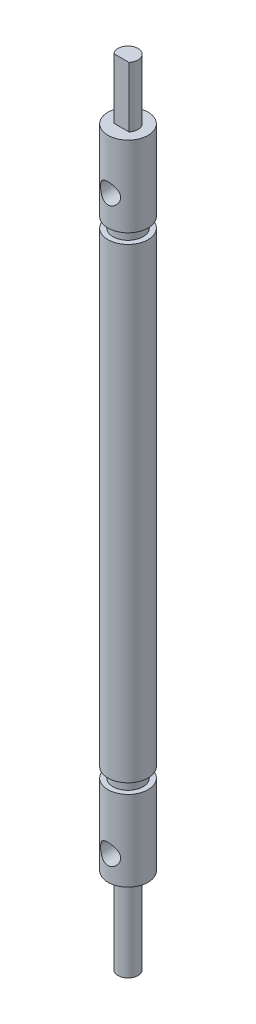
ISO-10303-21;
HEADER;
FILE_DESCRIPTION(('STEP AP214'),'2;1');
FILE_NAME('part.step','',(''),(''),'','','');
FILE_SCHEMA(('AUTOMOTIVE_DESIGN { 1 0 10303 214 1 1 1 1 }'));
ENDSEC;
DATA;
#1=APPLICATION_CONTEXT('core data for automotive mechanical design processes');
#2=APPLICATION_PROTOCOL_DEFINITION('international standard','automotive_design',2000,#1);
#3=PRODUCT_CONTEXT('',#1,'mechanical');
#4=PRODUCT('Part','Part','',(#3));
#5=PRODUCT_RELATED_PRODUCT_CATEGORY('part','',(#4));
#6=PRODUCT_DEFINITION_FORMATION('','',#4);
#7=PRODUCT_DEFINITION_CONTEXT('part definition',#1,'design');
#8=PRODUCT_DEFINITION('design','',#6,#7);
#9=PRODUCT_DEFINITION_SHAPE('','',#8);
#10=(LENGTH_UNIT() NAMED_UNIT(*) SI_UNIT(.MILLI.,.METRE.));
#11=(NAMED_UNIT(*) PLANE_ANGLE_UNIT() SI_UNIT($,.RADIAN.));
#12=(NAMED_UNIT(*) SI_UNIT($,.STERADIAN.) SOLID_ANGLE_UNIT());
#13=UNCERTAINTY_MEASURE_WITH_UNIT(LENGTH_MEASURE(1.E-05),#10,'distance_accuracy_value','');
#14=(GEOMETRIC_REPRESENTATION_CONTEXT(3) GLOBAL_UNCERTAINTY_ASSIGNED_CONTEXT((#13)) GLOBAL_UNIT_ASSIGNED_CONTEXT((#10,
#11,#12)) REPRESENTATION_CONTEXT('',''));
#15=CARTESIAN_POINT('',(0.,0.,0.));
#16=DIRECTION('',(0.,0.,1.));
#17=DIRECTION('',(1.,0.,0.));
#18=AXIS2_PLACEMENT_3D('',#15,#16,#17);
#19=CARTESIAN_POINT('',(1.,0.,0.));
#20=DIRECTION('',(0.,-1.,0.));
#21=DIRECTION('',(0.,0.,-1.));
#22=AXIS2_PLACEMENT_3D('',#19,#20,#21);
#23=PLANE('',#22);
#24=CARTESIAN_POINT('',(0.,0.,0.));
#25=DIRECTION('',(0.,-1.,0.));
#26=DIRECTION('',(0.,0.,-1.));
#27=AXIS2_PLACEMENT_3D('',#24,#25,#26);
#28=CIRCLE('',#27,1.);
#29=CARTESIAN_POINT('',(0.,0.,-1.));
#30=VERTEX_POINT('',#29);
#31=EDGE_CURVE('E123',#30,#30,#28,.T.);
#32=ORIENTED_EDGE('',*,*,#31,.T.);
#33=EDGE_LOOP('',(#32));
#34=FACE_BOUND('',#33,.T.);
#35=ADVANCED_FACE('F29',(#34),#23,.T.);
#36=CARTESIAN_POINT('',(0.,79.,0.));
#37=DIRECTION('',(0.,1.,0.));
#38=DIRECTION('',(0.,0.,1.));
#39=AXIS2_PLACEMENT_3D('',#36,#37,#38);
#40=PLANE('',#39);
#41=DIRECTION('',(-1.,0.,0.));
#42=VECTOR('',#41,1.);
#43=CARTESIAN_POINT('',(-0.75,79.,0.661437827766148));
#44=LINE('',#43,#42);
#45=CARTESIAN_POINT('',(0.75,79.,0.661437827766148));
#46=VERTEX_POINT('',#45);
#47=CARTESIAN_POINT('',(-0.75,79.,0.661437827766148));
#48=VERTEX_POINT('',#47);
#49=EDGE_CURVE('E59',#46,#48,#44,.T.);
#50=ORIENTED_EDGE('',*,*,#49,.F.);
#51=CARTESIAN_POINT('',(0.,79.,0.));
#52=DIRECTION('',(0.,-1.,0.));
#53=DIRECTION('',(0.,0.,-1.));
#54=AXIS2_PLACEMENT_3D('',#51,#52,#53);
#55=CIRCLE('',#54,1.);
#56=EDGE_CURVE('E69',#48,#46,#55,.T.);
#57=ORIENTED_EDGE('',*,*,#56,.F.);
#58=EDGE_LOOP('',(#50,#57));
#59=FACE_BOUND('',#58,.T.);
#60=ADVANCED_FACE('F68',(#59),#40,.T.);
#61=CARTESIAN_POINT('',(0.,0.,0.));
#62=DIRECTION('',(0.,-1.,0.));
#63=DIRECTION('',(0.,0.,-1.));
#64=AXIS2_PLACEMENT_3D('',#61,#62,#63);
#65=CYLINDRICAL_SURFACE('',#64,1.);
#66=DIRECTION('',(0.,1.,0.));
#67=VECTOR('',#66,1.);
#68=CARTESIAN_POINT('',(0.75,73.,0.661437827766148));
#69=LINE('',#68,#67);
#70=CARTESIAN_POINT('',(0.75,73.,0.661437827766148));
#71=VERTEX_POINT('',#70);
#72=EDGE_CURVE('E56',#71,#46,#69,.T.);
#73=ORIENTED_EDGE('',*,*,#72,.F.);
#74=CARTESIAN_POINT('',(0.,73.,0.));
#75=DIRECTION('',(0.,-1.,0.));
#76=DIRECTION('',(0.,0.,-1.));
#77=AXIS2_PLACEMENT_3D('',#74,#75,#76);
#78=CIRCLE('',#77,1.);
#79=CARTESIAN_POINT('',(-0.750000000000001,73.,0.661437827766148));
#80=VERTEX_POINT('',#79);
#81=EDGE_CURVE('E73',#80,#71,#78,.T.);
#82=ORIENTED_EDGE('',*,*,#81,.F.);
#83=DIRECTION('',(0.,1.,0.));
#84=VECTOR('',#83,1.);
#85=CARTESIAN_POINT('',(-0.75,73.,0.661437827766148));
#86=LINE('',#85,#84);
#87=EDGE_CURVE('E64',#80,#48,#86,.T.);
#88=ORIENTED_EDGE('',*,*,#87,.T.);
#89=ORIENTED_EDGE('',*,*,#56,.T.);
#90=EDGE_LOOP('',(#73,#82,#88,#89));
#91=FACE_BOUND('',#90,.T.);
#92=ADVANCED_FACE('F71',(#91),#65,.T.);
#93=CARTESIAN_POINT('',(1.,73.,0.));
#94=DIRECTION('',(0.,1.,0.));
#95=DIRECTION('',(0.,0.,1.));
#96=AXIS2_PLACEMENT_3D('',#93,#94,#95);
#97=PLANE('',#96);
#98=ORIENTED_EDGE('',*,*,#81,.T.);
#99=DIRECTION('',(-1.,0.,0.));
#100=VECTOR('',#99,1.);
#101=CARTESIAN_POINT('',(-0.75,73.,0.661437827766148));
#102=LINE('',#101,#100);
#103=EDGE_CURVE('E46',#71,#80,#102,.T.);
#104=ORIENTED_EDGE('',*,*,#103,.T.);
#105=EDGE_LOOP('',(#98,#104));
#106=FACE_BOUND('',#105,.T.);
#107=CARTESIAN_POINT('',(0.,73.,0.));
#108=DIRECTION('',(0.,-1.,0.));
#109=DIRECTION('',(0.,0.,-1.));
#110=AXIS2_PLACEMENT_3D('',#107,#108,#109);
#111=CIRCLE('',#110,2.);
#112=CARTESIAN_POINT('',(0.,73.,-2.));
#113=VERTEX_POINT('',#112);
#114=EDGE_CURVE('E78',#113,#113,#111,.T.);
#115=ORIENTED_EDGE('',*,*,#114,.F.);
#116=EDGE_LOOP('',(#115));
#117=FACE_BOUND('',#116,.T.);
#118=ADVANCED_FACE('F162',(#106,#117),#97,.T.);
#119=CARTESIAN_POINT('',(0.,0.,0.));
#120=DIRECTION('',(0.,-1.,0.));
#121=DIRECTION('',(0.,0.,-1.));
#122=AXIS2_PLACEMENT_3D('',#119,#120,#121);
#123=CYLINDRICAL_SURFACE('',#122,2.);
#124=CARTESIAN_POINT('',(0.,69.,-2.));
#125=CARTESIAN_POINT('',(0.052571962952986,68.9999966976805,-1.99999713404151));
#126=CARTESIAN_POINT('',(0.105206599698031,68.9958299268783,-1.99790491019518));
#127=CARTESIAN_POINT('',(0.208920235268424,68.9793471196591,-1.98974156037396));
#128=CARTESIAN_POINT('',(0.259996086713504,68.9670156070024,-1.98366287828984));
#129=CARTESIAN_POINT('',(0.358933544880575,68.9348061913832,-1.96816279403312));
#130=CARTESIAN_POINT('',(0.40680680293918,68.914957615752,-1.9587543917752));
#131=CARTESIAN_POINT('',(0.498472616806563,68.8684293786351,-1.93745776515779));
#132=CARTESIAN_POINT('',(0.542265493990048,68.8417502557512,-1.9255697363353));
#133=CARTESIAN_POINT('',(0.627507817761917,68.7804827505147,-1.89956258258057));
#134=CARTESIAN_POINT('',(0.668655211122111,68.7455135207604,-1.88535199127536));
#135=CARTESIAN_POINT('',(0.744779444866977,68.669478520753,-1.85659970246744));
#136=CARTESIAN_POINT('',(0.779751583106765,68.6284081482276,-1.84205776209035));
#137=CARTESIAN_POINT('',(0.845252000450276,68.5375166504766,-1.81298951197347));
#138=CARTESIAN_POINT('',(0.875225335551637,68.4872639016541,-1.79855186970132));
#139=CARTESIAN_POINT('',(0.926168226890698,68.3816326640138,-1.77285978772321));
#140=CARTESIAN_POINT('',(0.947144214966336,68.3262578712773,-1.7616030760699));
#141=CARTESIAN_POINT('',(0.97813244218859,68.2153348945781,-1.74457867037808));
#142=CARTESIAN_POINT('',(0.988725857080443,68.1599955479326,-1.73852271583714));
#143=CARTESIAN_POINT('',(1.00042699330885,68.0480211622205,-1.73181889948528));
#144=CARTESIAN_POINT('',(1.00154408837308,67.9913874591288,-1.73116569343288));
#145=CARTESIAN_POINT('',(0.994687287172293,67.8857139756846,-1.73510930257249));
#146=CARTESIAN_POINT('',(0.98778455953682,67.836575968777,-1.73908763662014));
#147=CARTESIAN_POINT('',(0.966939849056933,67.740278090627,-1.7507622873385));
#148=CARTESIAN_POINT('',(0.952995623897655,67.6931188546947,-1.75845978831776));
#149=CARTESIAN_POINT('',(0.918209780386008,67.6007708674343,-1.77687476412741));
#150=CARTESIAN_POINT('',(0.897215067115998,67.5556536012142,-1.78765840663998));
#151=CARTESIAN_POINT('',(0.849041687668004,67.46936570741,-1.81103404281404));
#152=CARTESIAN_POINT('',(0.821860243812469,67.4281968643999,-1.82362684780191));
#153=CARTESIAN_POINT('',(0.758066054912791,67.3454787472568,-1.85113157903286));
#154=CARTESIAN_POINT('',(0.720694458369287,67.3045431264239,-1.86613510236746));
#155=CARTESIAN_POINT('',(0.639555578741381,67.2292645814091,-1.89547623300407));
#156=CARTESIAN_POINT('',(0.595785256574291,67.1949248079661,-1.90981351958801));
#157=CARTESIAN_POINT('',(0.50051650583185,67.1323143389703,-1.93701987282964));
#158=CARTESIAN_POINT('',(0.448753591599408,67.1043995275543,-1.94978984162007));
#159=CARTESIAN_POINT('',(0.340466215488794,67.057902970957,-1.97157881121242));
#160=CARTESIAN_POINT('',(0.283945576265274,67.0393138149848,-1.98060078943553));
#161=CARTESIAN_POINT('',(0.1727664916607,67.0135245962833,-1.99324333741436));
#162=CARTESIAN_POINT('',(0.118341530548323,67.0055087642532,-1.99724938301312));
#163=CARTESIAN_POINT('',(0.00877959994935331,66.9985352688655,-2.00073013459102));
#164=CARTESIAN_POINT('',(-0.0463570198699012,66.9995733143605,-2.00020698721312));
#165=CARTESIAN_POINT('',(-0.151232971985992,67.0102066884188,-1.99491192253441));
#166=CARTESIAN_POINT('',(-0.201059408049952,67.01913253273,-1.9904724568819));
#167=CARTESIAN_POINT('',(-0.298406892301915,67.0442380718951,-1.97822171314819));
#168=CARTESIAN_POINT('',(-0.345927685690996,67.0604185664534,-1.97041006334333));
#169=CARTESIAN_POINT('',(-0.438888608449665,67.0999984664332,-1.9518425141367));
#170=CARTESIAN_POINT('',(-0.484230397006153,67.1235910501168,-1.94100881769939));
#171=CARTESIAN_POINT('',(-0.570461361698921,67.177107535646,-1.91743974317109));
#172=CARTESIAN_POINT('',(-0.611348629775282,67.2070341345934,-1.90470355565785));
#173=CARTESIAN_POINT('',(-0.691767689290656,67.2757604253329,-1.87708221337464));
#174=CARTESIAN_POINT('',(-0.730772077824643,67.3151428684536,-1.86210884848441));
#175=CARTESIAN_POINT('',(-0.801856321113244,67.3999251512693,-1.83262391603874));
#176=CARTESIAN_POINT('',(-0.833931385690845,67.4453291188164,-1.81811267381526));
#177=CARTESIAN_POINT('',(-0.891707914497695,67.5436436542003,-1.79051192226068));
#178=CARTESIAN_POINT('',(-0.917025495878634,67.5968112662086,-1.77752529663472));
#179=CARTESIAN_POINT('',(-0.958082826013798,67.7075100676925,-1.75574072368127));
#180=CARTESIAN_POINT('',(-0.973834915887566,67.7650355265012,-1.74693738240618));
#181=CARTESIAN_POINT('',(-0.993861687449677,67.8769102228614,-1.73561501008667));
#182=CARTESIAN_POINT('',(-0.999092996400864,67.931034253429,-1.73257383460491));
#183=CARTESIAN_POINT('',(-1.00068915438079,68.0394470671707,-1.73165354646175));
#184=CARTESIAN_POINT('',(-0.9970578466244,68.0937357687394,-1.73377219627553));
#185=CARTESIAN_POINT('',(-0.981926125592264,68.195483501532,-1.74237862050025));
#186=CARTESIAN_POINT('',(-0.971208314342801,68.2431004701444,-1.74843094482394));
#187=CARTESIAN_POINT('',(-0.943175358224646,68.3358081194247,-1.76371016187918));
#188=CARTESIAN_POINT('',(-0.92585809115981,68.380897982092,-1.77293807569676));
#189=CARTESIAN_POINT('',(-0.883815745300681,68.4706248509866,-1.79428530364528));
#190=CARTESIAN_POINT('',(-0.858671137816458,68.5150279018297,-1.80655722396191));
#191=CARTESIAN_POINT('',(-0.802150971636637,68.5992745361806,-1.8323533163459));
#192=CARTESIAN_POINT('',(-0.770772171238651,68.6391157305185,-1.84587813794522));
#193=CARTESIAN_POINT('',(-0.698203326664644,68.7181419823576,-1.87462323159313));
#194=CARTESIAN_POINT('',(-0.656284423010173,68.7566591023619,-1.88984983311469));
#195=CARTESIAN_POINT('',(-0.566154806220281,68.8262629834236,-1.91877752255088));
#196=CARTESIAN_POINT('',(-0.517940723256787,68.8573457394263,-1.9324777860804));
#197=CARTESIAN_POINT('',(-0.41593159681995,68.9112363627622,-1.95698009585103));
#198=CARTESIAN_POINT('',(-0.36209950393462,68.9339841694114,-1.96776096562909));
#199=CARTESIAN_POINT('',(-0.250742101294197,68.969808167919,-1.98501341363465));
#200=CARTESIAN_POINT('',(-0.193227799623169,68.9829118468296,-1.99149723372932));
#201=CARTESIAN_POINT('',(-0.112601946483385,68.9938974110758,-1.99695461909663));
#202=CARTESIAN_POINT('',(-0.0901618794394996,68.9961826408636,-1.99809365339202));
#203=CARTESIAN_POINT('',(-0.0451517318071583,68.9992346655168,-1.99961696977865));
#204=CARTESIAN_POINT('',(-0.0225816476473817,69.0000014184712,-2.00000123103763));
#205=CARTESIAN_POINT('',(0.,69.,-2.));
#206=B_SPLINE_CURVE_WITH_KNOTS('',3,(#124,#125,#126,#127,#128,#129,#130,#131,#132,#133,#134,
#135,#136,#137,#138,#139,#140,#141,#142,#143,#144,#145,#146,#147,#148,#149,#150,#151,#152,#153,
#154,#155,#156,#157,#158,#159,#160,#161,#162,#163,#164,#165,#166,#167,#168,#169,#170,#171,#172,
#173,#174,#175,#176,#177,#178,#179,#180,#181,#182,#183,#184,#185,#186,#187,#188,#189,#190,#191,
#192,#193,#194,#195,#196,#197,#198,#199,#200,#201,#202,#203,#204,#205),.UNSPECIFIED.,.T.,.F.,(4,
2,2,2,2,2,2,2,2,2,2,2,2,2,2,2,2,2,2,2,2,2,2,2,2,2,2,2,2,2,2,2,2,2,2,2,2,2,2,2,4),(0.,
0.157624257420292,0.315548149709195,0.472862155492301,0.630163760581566,0.796981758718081,
0.963926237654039,1.14381726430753,1.32357947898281,1.4925801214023,1.66141357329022,
1.8100571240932,1.95874803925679,2.11090240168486,2.26312521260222,2.43464941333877,
2.60625534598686,2.78583022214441,2.9652621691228,3.12983290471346,3.29432564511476,
3.44606906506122,3.59782921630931,3.75392856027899,3.91009450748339,4.0815961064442,
4.25321588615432,4.43314682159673,4.61284511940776,4.77529307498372,4.93767059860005,
5.08457930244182,5.23153528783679,5.38836456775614,5.54527561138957,5.72125242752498,
5.89732383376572,6.07464013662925,6.2514490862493,6.31915280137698,6.38685838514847),.UNSPECIFIED.);
#207=CARTESIAN_POINT('',(0.,69.,-2.));
#208=VERTEX_POINT('',#207);
#209=EDGE_CURVE('E11',#208,#208,#206,.T.);
#210=ORIENTED_EDGE('',*,*,#209,.F.);
#211=EDGE_LOOP('',(#210));
#212=FACE_BOUND('',#211,.T.);
#213=CARTESIAN_POINT('',(1.,68.,1.73205080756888));
#214=CARTESIAN_POINT('',(0.999996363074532,68.0521078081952,1.73205534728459));
#215=CARTESIAN_POINT('',(0.995899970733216,68.1042814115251,1.73443801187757));
#216=CARTESIAN_POINT('',(0.979723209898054,68.2070272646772,1.74362366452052));
#217=CARTESIAN_POINT('',(0.967626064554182,68.2575959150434,1.75043594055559));
#218=CARTESIAN_POINT('',(0.936099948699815,68.3554516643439,1.76749346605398));
#219=CARTESIAN_POINT('',(0.916709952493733,68.4027546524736,1.77772043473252));
#220=CARTESIAN_POINT('',(0.871267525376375,68.4934242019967,1.80042664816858));
#221=CARTESIAN_POINT('',(0.845214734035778,68.5367905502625,1.81290601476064));
#222=CARTESIAN_POINT('',(0.784666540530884,68.6223057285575,1.83996869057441));
#223=CARTESIAN_POINT('',(0.749652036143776,68.6640591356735,1.85464063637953));
#224=CARTESIAN_POINT('',(0.673253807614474,68.7414083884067,1.88371982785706));
#225=CARTESIAN_POINT('',(0.631866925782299,68.7770011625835,1.8981269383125));
#226=CARTESIAN_POINT('',(0.540489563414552,68.8433671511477,1.92621476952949));
#227=CARTESIAN_POINT('',(0.490107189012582,68.8736537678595,1.93978106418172));
#228=CARTESIAN_POINT('',(0.384157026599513,68.9251408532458,1.96350756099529));
#229=CARTESIAN_POINT('',(0.328592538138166,68.9463470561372,1.97366991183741));
#230=CARTESIAN_POINT('',(0.21804494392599,68.9775046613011,1.98880461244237));
#231=CARTESIAN_POINT('',(0.16330179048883,68.9881495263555,1.99409480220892));
#232=CARTESIAN_POINT('',(0.0525706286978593,69.000166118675,2.00007583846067));
#233=CARTESIAN_POINT('',(-0.00341660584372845,69.0015434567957,2.0007694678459));
#234=CARTESIAN_POINT('',(-0.109832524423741,68.9952533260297,1.9976298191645));
#235=CARTESIAN_POINT('',(-0.160321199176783,68.9883619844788,1.99418495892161));
#236=CARTESIAN_POINT('',(-0.259313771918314,68.9671191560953,1.98374245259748));
#237=CARTESIAN_POINT('',(-0.307817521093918,68.9527671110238,1.97674454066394));
#238=CARTESIAN_POINT('',(-0.402309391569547,68.9169174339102,1.95971583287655));
#239=CARTESIAN_POINT('',(-0.448253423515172,68.895323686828,1.94964441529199));
#240=CARTESIAN_POINT('',(-0.535976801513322,68.8457365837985,1.92737645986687));
#241=CARTESIAN_POINT('',(-0.577754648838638,68.8177409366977,1.91517916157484));
#242=CARTESIAN_POINT('',(-0.660173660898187,68.753104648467,1.8884439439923));
#243=CARTESIAN_POINT('',(-0.700334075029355,68.715896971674,1.87379375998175));
#244=CARTESIAN_POINT('',(-0.774104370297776,68.6354102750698,1.84454340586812));
#245=CARTESIAN_POINT('',(-0.807709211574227,68.5921266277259,1.82994328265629));
#246=CARTESIAN_POINT('',(-0.869505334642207,68.4973518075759,1.80144156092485));
#247=CARTESIAN_POINT('',(-0.897217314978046,68.4455139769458,1.78764319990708));
#248=CARTESIAN_POINT('',(-0.943319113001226,68.337062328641,1.76375450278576));
#249=CARTESIAN_POINT('',(-0.961718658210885,68.2804535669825,1.75366030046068));
#250=CARTESIAN_POINT('',(-0.987180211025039,68.1687854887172,1.73944635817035));
#251=CARTESIAN_POINT('',(-0.995025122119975,68.1139588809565,1.73491655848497));
#252=CARTESIAN_POINT('',(-1.00151694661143,68.0035986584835,1.7311791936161));
#253=CARTESIAN_POINT('',(-1.00017035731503,67.9480655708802,1.73196786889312));
#254=CARTESIAN_POINT('',(-0.989036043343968,67.8443460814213,1.73834336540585));
#255=CARTESIAN_POINT('',(-0.98018781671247,67.7960205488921,1.74339587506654));
#256=CARTESIAN_POINT('',(-0.955696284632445,67.7016322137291,1.75694021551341));
#257=CARTESIAN_POINT('',(-0.940050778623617,67.6555701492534,1.76543316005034));
#258=CARTESIAN_POINT('',(-0.90164758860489,67.5645886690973,1.78536222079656));
#259=CARTESIAN_POINT('',(-0.87859406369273,67.5198209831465,1.79691643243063));
#260=CARTESIAN_POINT('',(-0.826287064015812,67.434530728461,1.82156119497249));
#261=CARTESIAN_POINT('',(-0.797030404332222,67.3940103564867,1.83465253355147));
#262=CARTESIAN_POINT('',(-0.728837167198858,67.3130212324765,1.86287998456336));
#263=CARTESIAN_POINT('',(-0.689145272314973,67.2732028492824,1.87806583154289));
#264=CARTESIAN_POINT('',(-0.603404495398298,67.2005877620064,1.90734234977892));
#265=CARTESIAN_POINT('',(-0.557353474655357,67.1677934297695,1.92143265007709));
#266=CARTESIAN_POINT('',(-0.45853536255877,67.1094262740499,1.94741361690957));
#267=CARTESIAN_POINT('',(-0.405623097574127,67.0840668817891,1.95923641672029));
#268=CARTESIAN_POINT('',(-0.295522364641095,67.0428620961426,1.97883354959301));
#269=CARTESIAN_POINT('',(-0.238337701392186,67.0270083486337,1.98661143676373));
#270=CARTESIAN_POINT('',(-0.126979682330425,67.0066314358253,1.99667508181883));
#271=CARTESIAN_POINT('',(-0.0730114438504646,67.0012021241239,1.99939927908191));
#272=CARTESIAN_POINT('',(0.0351259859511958,66.9991567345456,2.00042130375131));
#273=CARTESIAN_POINT('',(0.0892951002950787,67.0025375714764,1.9987206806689));
#274=CARTESIAN_POINT('',(0.19253799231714,67.0174164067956,1.99133968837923));
#275=CARTESIAN_POINT('',(0.241712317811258,67.0283648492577,1.9859289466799));
#276=CARTESIAN_POINT('',(0.337445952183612,67.057326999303,1.97192093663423));
#277=CARTESIAN_POINT('',(0.384004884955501,67.0753417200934,1.96332321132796));
#278=CARTESIAN_POINT('',(0.475423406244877,67.118727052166,1.9432593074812));
#279=CARTESIAN_POINT('',(0.52012514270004,67.1443793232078,1.93168617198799));
#280=CARTESIAN_POINT('',(0.604774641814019,67.2019579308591,1.90688133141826));
#281=CARTESIAN_POINT('',(0.6447202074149,67.2338871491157,1.89364886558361));
#282=CARTESIAN_POINT('',(0.722914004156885,67.3067971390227,1.86528610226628));
#283=CARTESIAN_POINT('',(0.760597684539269,67.3483624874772,1.85009799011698));
#284=CARTESIAN_POINT('',(0.828663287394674,67.4374507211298,1.82063076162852));
#285=CARTESIAN_POINT('',(0.859038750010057,67.4849788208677,1.80635245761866));
#286=CARTESIAN_POINT('',(0.912431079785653,67.586636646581,1.77999605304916));
#287=CARTESIAN_POINT('',(0.935185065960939,67.6409275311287,1.7680017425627));
#288=CARTESIAN_POINT('',(0.970878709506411,67.7533324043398,1.74866156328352));
#289=CARTESIAN_POINT('',(0.983851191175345,67.8114328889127,1.74130016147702));
#290=CARTESIAN_POINT('',(0.994367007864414,67.891805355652,1.73529272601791));
#291=CARTESIAN_POINT('',(0.99647610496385,67.9133678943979,1.73408129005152));
#292=CARTESIAN_POINT('',(0.999293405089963,67.9566164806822,1.7324593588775));
#293=CARTESIAN_POINT('',(1.00000151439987,67.9783025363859,1.73204891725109));
#294=CARTESIAN_POINT('',(1.,68.,1.73205080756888));
#295=B_SPLINE_CURVE_WITH_KNOTS('',3,(#213,#214,#215,#216,#217,#218,#219,#220,#221,#222,#223,
#224,#225,#226,#227,#228,#229,#230,#231,#232,#233,#234,#235,#236,#237,#238,#239,#240,#241,#242,
#243,#244,#245,#246,#247,#248,#249,#250,#251,#252,#253,#254,#255,#256,#257,#258,#259,#260,#261,
#262,#263,#264,#265,#266,#267,#268,#269,#270,#271,#272,#273,#274,#275,#276,#277,#278,#279,#280,
#281,#282,#283,#284,#285,#286,#287,#288,#289,#290,#291,#292,#293,#294),.UNSPECIFIED.,.T.,.F.,(4,
2,2,2,2,2,2,2,2,2,2,2,2,2,2,2,2,2,2,2,2,2,2,2,2,2,2,2,2,2,2,2,2,2,2,2,2,2,2,2,4),(0.,
0.15623212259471,0.312792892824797,0.468528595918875,0.62427272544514,0.792862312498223,
0.961535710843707,1.14157892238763,1.3215082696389,1.48863484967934,1.65566023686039,
1.80816097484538,1.96067312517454,2.11529534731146,2.26997299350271,2.4392719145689,
2.60870048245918,2.78888841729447,2.96888774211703,3.13462290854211,3.30024093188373,
3.44774183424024,3.59529052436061,3.74967296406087,3.90413486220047,4.07806743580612,
4.25205864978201,4.43064181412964,4.60906779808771,4.77112270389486,4.93312086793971,
5.08444424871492,5.23578933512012,5.39360750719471,5.55149830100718,5.72510241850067,
5.89885942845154,6.07810749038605,6.25675133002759,6.32180135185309,6.38685572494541),.UNSPECIFIED.);
#296=CARTESIAN_POINT('',(1.,68.,1.73205080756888));
#297=VERTEX_POINT('',#296);
#298=EDGE_CURVE('E40',#297,#297,#295,.T.);
#299=ORIENTED_EDGE('',*,*,#298,.F.);
#300=EDGE_LOOP('',(#299));
#301=FACE_BOUND('',#300,.T.);
#302=ORIENTED_EDGE('',*,*,#114,.T.);
#303=EDGE_LOOP('',(#302));
#304=FACE_BOUND('',#303,.T.);
#305=CARTESIAN_POINT('',(0.,65.,0.));
#306=DIRECTION('',(0.,-1.,0.));
#307=DIRECTION('',(0.,0.,-1.));
#308=AXIS2_PLACEMENT_3D('',#305,#306,#307);
#309=CIRCLE('',#308,2.);
#310=CARTESIAN_POINT('',(0.,65.,-2.));
#311=VERTEX_POINT('',#310);
#312=EDGE_CURVE('E154',#311,#311,#309,.T.);
#313=ORIENTED_EDGE('',*,*,#312,.F.);
#314=EDGE_LOOP('',(#313));
#315=FACE_BOUND('',#314,.T.);
#316=ADVANCED_FACE('F159',(#212,#301,#304,#315),#123,.T.);
#317=CARTESIAN_POINT('',(2.,65.,0.));
#318=DIRECTION('',(0.,-1.,0.));
#319=DIRECTION('',(0.,0.,-1.));
#320=AXIS2_PLACEMENT_3D('',#317,#318,#319);
#321=PLANE('',#320);
#322=ORIENTED_EDGE('',*,*,#312,.T.);
#323=EDGE_LOOP('',(#322));
#324=FACE_BOUND('',#323,.T.);
#325=CARTESIAN_POINT('',(0.,65.,0.));
#326=DIRECTION('',(0.,-1.,0.));
#327=DIRECTION('',(0.,0.,-1.));
#328=AXIS2_PLACEMENT_3D('',#325,#326,#327);
#329=CIRCLE('',#328,1.5);
#330=CARTESIAN_POINT('',(0.,65.,-1.5));
#331=VERTEX_POINT('',#330);
#332=EDGE_CURVE('E151',#331,#331,#329,.T.);
#333=ORIENTED_EDGE('',*,*,#332,.F.);
#334=EDGE_LOOP('',(#333));
#335=FACE_BOUND('',#334,.T.);
#336=ADVANCED_FACE('F170',(#324,#335),#321,.T.);
#337=CARTESIAN_POINT('',(0.,0.,0.));
#338=DIRECTION('',(0.,-1.,0.));
#339=DIRECTION('',(0.,0.,-1.));
#340=AXIS2_PLACEMENT_3D('',#337,#338,#339);
#341=CYLINDRICAL_SURFACE('',#340,1.5);
#342=ORIENTED_EDGE('',*,*,#332,.T.);
#343=EDGE_LOOP('',(#342));
#344=FACE_BOUND('',#343,.T.);
#345=CARTESIAN_POINT('',(0.,64.,0.));
#346=DIRECTION('',(0.,-1.,0.));
#347=DIRECTION('',(0.,0.,-1.));
#348=AXIS2_PLACEMENT_3D('',#345,#346,#347);
#349=CIRCLE('',#348,1.5);
#350=CARTESIAN_POINT('',(0.,64.,-1.5));
#351=VERTEX_POINT('',#350);
#352=EDGE_CURVE('E148',#351,#351,#349,.T.);
#353=ORIENTED_EDGE('',*,*,#352,.F.);
#354=EDGE_LOOP('',(#353));
#355=FACE_BOUND('',#354,.T.);
#356=ADVANCED_FACE('F210',(#344,#355),#341,.T.);
#357=CARTESIAN_POINT('',(1.5,64.,0.));
#358=DIRECTION('',(0.,1.,0.));
#359=DIRECTION('',(0.,0.,1.));
#360=AXIS2_PLACEMENT_3D('',#357,#358,#359);
#361=PLANE('',#360);
#362=ORIENTED_EDGE('',*,*,#352,.T.);
#363=EDGE_LOOP('',(#362));
#364=FACE_BOUND('',#363,.T.);
#365=CARTESIAN_POINT('',(0.,64.,0.));
#366=DIRECTION('',(0.,-1.,0.));
#367=DIRECTION('',(0.,0.,-1.));
#368=AXIS2_PLACEMENT_3D('',#365,#366,#367);
#369=CIRCLE('',#368,2.);
#370=CARTESIAN_POINT('',(0.,64.,-2.));
#371=VERTEX_POINT('',#370);
#372=EDGE_CURVE('E145',#371,#371,#369,.T.);
#373=ORIENTED_EDGE('',*,*,#372,.F.);
#374=EDGE_LOOP('',(#373));
#375=FACE_BOUND('',#374,.T.);
#376=ADVANCED_FACE('F207',(#364,#375),#361,.T.);
#377=CARTESIAN_POINT('',(0.,0.,0.));
#378=DIRECTION('',(0.,-1.,0.));
#379=DIRECTION('',(0.,0.,-1.));
#380=AXIS2_PLACEMENT_3D('',#377,#378,#379);
#381=CYLINDRICAL_SURFACE('',#380,2.);
#382=ORIENTED_EDGE('',*,*,#372,.T.);
#383=EDGE_LOOP('',(#382));
#384=FACE_BOUND('',#383,.T.);
#385=CARTESIAN_POINT('',(0.,17.5444611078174,0.));
#386=DIRECTION('',(0.,-1.,0.));
#387=DIRECTION('',(0.,0.,-1.));
#388=AXIS2_PLACEMENT_3D('',#385,#386,#387);
#389=CIRCLE('',#388,2.00000000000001);
#390=CARTESIAN_POINT('',(0.,17.5444611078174,-2.00000000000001));
#391=VERTEX_POINT('',#390);
#392=EDGE_CURVE('E142',#391,#391,#389,.T.);
#393=ORIENTED_EDGE('',*,*,#392,.F.);
#394=EDGE_LOOP('',(#393));
#395=FACE_BOUND('',#394,.T.);
#396=ADVANCED_FACE('F203',(#384,#395),#381,.T.);
#397=CARTESIAN_POINT('',(2.00000000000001,17.5444611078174,0.));
#398=DIRECTION('',(0.,-1.,0.));
#399=DIRECTION('',(0.,0.,-1.));
#400=AXIS2_PLACEMENT_3D('',#397,#398,#399);
#401=PLANE('',#400);
#402=ORIENTED_EDGE('',*,*,#392,.T.);
#403=EDGE_LOOP('',(#402));
#404=FACE_BOUND('',#403,.T.);
#405=CARTESIAN_POINT('',(0.,17.5444611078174,0.));
#406=DIRECTION('',(0.,-1.,0.));
#407=DIRECTION('',(0.,0.,-1.));
#408=AXIS2_PLACEMENT_3D('',#405,#406,#407);
#409=CIRCLE('',#408,1.5);
#410=CARTESIAN_POINT('',(0.,17.5444611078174,-1.5));
#411=VERTEX_POINT('',#410);
#412=EDGE_CURVE('E139',#411,#411,#409,.T.);
#413=ORIENTED_EDGE('',*,*,#412,.F.);
#414=EDGE_LOOP('',(#413));
#415=FACE_BOUND('',#414,.T.);
#416=ADVANCED_FACE('F197',(#404,#415),#401,.T.);
#417=CARTESIAN_POINT('',(0.,0.,0.));
#418=DIRECTION('',(0.,-1.,0.));
#419=DIRECTION('',(0.,0.,-1.));
#420=AXIS2_PLACEMENT_3D('',#417,#418,#419);
#421=CYLINDRICAL_SURFACE('',#420,1.5);
#422=ORIENTED_EDGE('',*,*,#412,.T.);
#423=EDGE_LOOP('',(#422));
#424=FACE_BOUND('',#423,.T.);
#425=CARTESIAN_POINT('',(0.,16.5444611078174,0.));
#426=DIRECTION('',(0.,-1.,0.));
#427=DIRECTION('',(0.,0.,-1.));
#428=AXIS2_PLACEMENT_3D('',#425,#426,#427);
#429=CIRCLE('',#428,1.5);
#430=CARTESIAN_POINT('',(0.,16.5444611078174,-1.5));
#431=VERTEX_POINT('',#430);
#432=EDGE_CURVE('E136',#431,#431,#429,.T.);
#433=ORIENTED_EDGE('',*,*,#432,.F.);
#434=EDGE_LOOP('',(#433));
#435=FACE_BOUND('',#434,.T.);
#436=ADVANCED_FACE('F192',(#424,#435),#421,.T.);
#437=CARTESIAN_POINT('',(1.5,16.5444611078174,0.));
#438=DIRECTION('',(0.,1.,0.));
#439=DIRECTION('',(0.,0.,1.));
#440=AXIS2_PLACEMENT_3D('',#437,#438,#439);
#441=PLANE('',#440);
#442=ORIENTED_EDGE('',*,*,#432,.T.);
#443=EDGE_LOOP('',(#442));
#444=FACE_BOUND('',#443,.T.);
#445=CARTESIAN_POINT('',(0.,16.5444611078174,0.));
#446=DIRECTION('',(0.,-1.,0.));
#447=DIRECTION('',(0.,0.,-1.));
#448=AXIS2_PLACEMENT_3D('',#445,#446,#447);
#449=CIRCLE('',#448,2.);
#450=CARTESIAN_POINT('',(0.,16.5444611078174,-2.));
#451=VERTEX_POINT('',#450);
#452=EDGE_CURVE('E133',#451,#451,#449,.T.);
#453=ORIENTED_EDGE('',*,*,#452,.F.);
#454=EDGE_LOOP('',(#453));
#455=FACE_BOUND('',#454,.T.);
#456=ADVANCED_FACE('F111',(#444,#455),#441,.T.);
#457=CARTESIAN_POINT('',(0.,0.,0.));
#458=DIRECTION('',(0.,-1.,0.));
#459=DIRECTION('',(0.,0.,-1.));
#460=AXIS2_PLACEMENT_3D('',#457,#458,#459);
#461=CYLINDRICAL_SURFACE('',#460,2.);
#462=CARTESIAN_POINT('',(0.,12.,-2.));
#463=CARTESIAN_POINT('',(0.0525719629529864,11.9999966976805,-1.99999713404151));
#464=CARTESIAN_POINT('',(0.105206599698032,11.9958299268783,-1.99790491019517));
#465=CARTESIAN_POINT('',(0.208920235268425,11.9793471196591,-1.98974156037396));
#466=CARTESIAN_POINT('',(0.259996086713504,11.9670156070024,-1.98366287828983));
#467=CARTESIAN_POINT('',(0.358933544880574,11.9348061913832,-1.96816279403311));
#468=CARTESIAN_POINT('',(0.40680680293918,11.914957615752,-1.9587543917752));
#469=CARTESIAN_POINT('',(0.498472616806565,11.8684293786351,-1.93745776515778));
#470=CARTESIAN_POINT('',(0.54226549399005,11.8417502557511,-1.9255697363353));
#471=CARTESIAN_POINT('',(0.627507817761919,11.7804827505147,-1.89956258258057));
#472=CARTESIAN_POINT('',(0.668655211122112,11.7455135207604,-1.88535199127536));
#473=CARTESIAN_POINT('',(0.744779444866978,11.669478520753,-1.85659970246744));
#474=CARTESIAN_POINT('',(0.779751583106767,11.6284081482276,-1.84205776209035));
#475=CARTESIAN_POINT('',(0.845252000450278,11.5375166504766,-1.81298951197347));
#476=CARTESIAN_POINT('',(0.875225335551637,11.4872639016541,-1.79855186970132));
#477=CARTESIAN_POINT('',(0.926168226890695,11.3816326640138,-1.7728597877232));
#478=CARTESIAN_POINT('',(0.947144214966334,11.3262578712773,-1.76160307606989));
#479=CARTESIAN_POINT('',(0.978132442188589,11.2153348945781,-1.74457867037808));
#480=CARTESIAN_POINT('',(0.988725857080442,11.1599955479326,-1.73852271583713));
#481=CARTESIAN_POINT('',(1.00042699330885,11.0480211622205,-1.73181889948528));
#482=CARTESIAN_POINT('',(1.00154408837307,10.9913874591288,-1.73116569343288));
#483=CARTESIAN_POINT('',(0.994687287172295,10.8857139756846,-1.73510930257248));
#484=CARTESIAN_POINT('',(0.987784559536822,10.8365759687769,-1.73908763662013));
#485=CARTESIAN_POINT('',(0.966939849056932,10.740278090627,-1.7507622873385));
#486=CARTESIAN_POINT('',(0.952995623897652,10.6931188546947,-1.75845978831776));
#487=CARTESIAN_POINT('',(0.918209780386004,10.6007708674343,-1.77687476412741));
#488=CARTESIAN_POINT('',(0.897215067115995,10.5556536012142,-1.78765840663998));
#489=CARTESIAN_POINT('',(0.849041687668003,10.46936570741,-1.81103404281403));
#490=CARTESIAN_POINT('',(0.821860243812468,10.4281968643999,-1.8236268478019));
#491=CARTESIAN_POINT('',(0.758066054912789,10.3454787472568,-1.85113157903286));
#492=CARTESIAN_POINT('',(0.720694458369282,10.3045431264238,-1.86613510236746));
#493=CARTESIAN_POINT('',(0.639555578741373,10.2292645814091,-1.89547623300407));
#494=CARTESIAN_POINT('',(0.595785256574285,10.1949248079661,-1.90981351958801));
#495=CARTESIAN_POINT('',(0.500516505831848,10.1323143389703,-1.93701987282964));
#496=CARTESIAN_POINT('',(0.448753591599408,10.1043995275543,-1.94978984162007));
#497=CARTESIAN_POINT('',(0.340466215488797,10.057902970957,-1.97157881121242));
#498=CARTESIAN_POINT('',(0.283945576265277,10.0393138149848,-1.98060078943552));
#499=CARTESIAN_POINT('',(0.172766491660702,10.0135245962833,-1.99324333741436));
#500=CARTESIAN_POINT('',(0.118341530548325,10.0055087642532,-1.99724938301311));
#501=CARTESIAN_POINT('',(0.00877959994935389,9.99853526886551,-2.00073013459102));
#502=CARTESIAN_POINT('',(-0.0463570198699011,9.99957331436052,-2.00020698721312));
#503=CARTESIAN_POINT('',(-0.151232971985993,10.0102066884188,-1.99491192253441));
#504=CARTESIAN_POINT('',(-0.201059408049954,10.01913253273,-1.99047245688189));
#505=CARTESIAN_POINT('',(-0.298406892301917,10.0442380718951,-1.97822171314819));
#506=CARTESIAN_POINT('',(-0.345927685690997,10.0604185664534,-1.97041006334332));
#507=CARTESIAN_POINT('',(-0.438888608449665,10.0999984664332,-1.95184251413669));
#508=CARTESIAN_POINT('',(-0.484230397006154,10.1235910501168,-1.94100881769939));
#509=CARTESIAN_POINT('',(-0.570461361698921,10.177107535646,-1.91743974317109));
#510=CARTESIAN_POINT('',(-0.611348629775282,10.2070341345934,-1.90470355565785));
#511=CARTESIAN_POINT('',(-0.691767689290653,10.2757604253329,-1.87708221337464));
#512=CARTESIAN_POINT('',(-0.730772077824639,10.3151428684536,-1.86210884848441));
#513=CARTESIAN_POINT('',(-0.801856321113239,10.3999251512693,-1.83262391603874));
#514=CARTESIAN_POINT('',(-0.833931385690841,10.4453291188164,-1.81811267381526));
#515=CARTESIAN_POINT('',(-0.891707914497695,10.5436436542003,-1.79051192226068));
#516=CARTESIAN_POINT('',(-0.917025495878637,10.5968112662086,-1.77752529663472));
#517=CARTESIAN_POINT('',(-0.958082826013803,10.7075100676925,-1.75574072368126));
#518=CARTESIAN_POINT('',(-0.97383491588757,10.7650355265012,-1.74693738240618));
#519=CARTESIAN_POINT('',(-0.993861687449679,10.8769102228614,-1.73561501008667));
#520=CARTESIAN_POINT('',(-0.999092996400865,10.931034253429,-1.73257383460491));
#521=CARTESIAN_POINT('',(-1.00068915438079,11.0394470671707,-1.73165354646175));
#522=CARTESIAN_POINT('',(-0.997057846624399,11.0937357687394,-1.73377219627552));
#523=CARTESIAN_POINT('',(-0.981926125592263,11.195483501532,-1.74237862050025));
#524=CARTESIAN_POINT('',(-0.9712083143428,11.2431004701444,-1.74843094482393));
#525=CARTESIAN_POINT('',(-0.943175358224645,11.3358081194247,-1.76371016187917));
#526=CARTESIAN_POINT('',(-0.92585809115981,11.380897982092,-1.77293807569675));
#527=CARTESIAN_POINT('',(-0.883815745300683,11.4706248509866,-1.79428530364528));
#528=CARTESIAN_POINT('',(-0.858671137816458,11.5150279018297,-1.8065572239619));
#529=CARTESIAN_POINT('',(-0.802150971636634,11.5992745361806,-1.8323533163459));
#530=CARTESIAN_POINT('',(-0.770772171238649,11.6391157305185,-1.84587813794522));
#531=CARTESIAN_POINT('',(-0.698203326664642,11.7181419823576,-1.87462323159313));
#532=CARTESIAN_POINT('',(-0.656284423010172,11.7566591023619,-1.88984983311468));
#533=CARTESIAN_POINT('',(-0.56615480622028,11.8262629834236,-1.91877752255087));
#534=CARTESIAN_POINT('',(-0.517940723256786,11.8573457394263,-1.9324777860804));
#535=CARTESIAN_POINT('',(-0.415931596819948,11.9112363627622,-1.95698009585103));
#536=CARTESIAN_POINT('',(-0.362099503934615,11.9339841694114,-1.96776096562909));
#537=CARTESIAN_POINT('',(-0.250742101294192,11.969808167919,-1.98501341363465));
#538=CARTESIAN_POINT('',(-0.193227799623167,11.9829118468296,-1.99149723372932));
#539=CARTESIAN_POINT('',(-0.112601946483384,11.9938974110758,-1.99695461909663));
#540=CARTESIAN_POINT('',(-0.090161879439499,11.9961826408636,-1.99809365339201));
#541=CARTESIAN_POINT('',(-0.0451517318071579,11.9992346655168,-1.99961696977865));
#542=CARTESIAN_POINT('',(-0.0225816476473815,12.0000014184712,-2.00000123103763));
#543=CARTESIAN_POINT('',(0.,12.,-2.));
#544=B_SPLINE_CURVE_WITH_KNOTS('',3,(#462,#463,#464,#465,#466,#467,#468,#469,#470,#471,#472,
#473,#474,#475,#476,#477,#478,#479,#480,#481,#482,#483,#484,#485,#486,#487,#488,#489,#490,#491,
#492,#493,#494,#495,#496,#497,#498,#499,#500,#501,#502,#503,#504,#505,#506,#507,#508,#509,#510,
#511,#512,#513,#514,#515,#516,#517,#518,#519,#520,#521,#522,#523,#524,#525,#526,#527,#528,#529,
#530,#531,#532,#533,#534,#535,#536,#537,#538,#539,#540,#541,#542,#543),.UNSPECIFIED.,.T.,.F.,(4,
2,2,2,2,2,2,2,2,2,2,2,2,2,2,2,2,2,2,2,2,2,2,2,2,2,2,2,2,2,2,2,2,2,2,2,2,2,2,2,4),(0.,
0.157624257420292,0.315548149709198,0.472862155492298,0.630163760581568,0.796981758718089,
0.963926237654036,1.14381726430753,1.32357947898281,1.4925801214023,1.66141357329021,
1.81005712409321,1.95874803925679,2.11090240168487,2.26312521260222,2.43464941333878,
2.60625534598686,2.78583022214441,2.9652621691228,3.12983290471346,3.29432564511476,
3.44606906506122,3.59782921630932,3.75392856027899,3.91009450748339,4.08159610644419,
4.25321588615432,4.43314682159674,4.61284511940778,4.77529307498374,4.93767059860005,
5.08457930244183,5.23153528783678,5.38836456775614,5.54527561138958,5.72125242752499,
5.89732383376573,6.07464013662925,6.2514490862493,6.31915280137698,6.38685838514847),.UNSPECIFIED.);
#545=CARTESIAN_POINT('',(0.,12.,-2.));
#546=VERTEX_POINT('',#545);
#547=EDGE_CURVE('E76',#546,#546,#544,.T.);
#548=ORIENTED_EDGE('',*,*,#547,.F.);
#549=EDGE_LOOP('',(#548));
#550=FACE_BOUND('',#549,.T.);
#551=CARTESIAN_POINT('',(1.,11.,1.73205080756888));
#552=CARTESIAN_POINT('',(0.999996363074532,11.0521078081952,1.73205534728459));
#553=CARTESIAN_POINT('',(0.995899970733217,11.104281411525,1.73443801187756));
#554=CARTESIAN_POINT('',(0.979723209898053,11.2070272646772,1.74362366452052));
#555=CARTESIAN_POINT('',(0.967626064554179,11.2575959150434,1.75043594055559));
#556=CARTESIAN_POINT('',(0.936099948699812,11.3554516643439,1.76749346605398));
#557=CARTESIAN_POINT('',(0.916709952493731,11.4027546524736,1.77772043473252));
#558=CARTESIAN_POINT('',(0.871267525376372,11.4934242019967,1.80042664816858));
#559=CARTESIAN_POINT('',(0.845214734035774,11.5367905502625,1.81290601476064));
#560=CARTESIAN_POINT('',(0.78466654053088,11.6223057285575,1.83996869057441));
#561=CARTESIAN_POINT('',(0.749652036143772,11.6640591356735,1.85464063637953));
#562=CARTESIAN_POINT('',(0.67325380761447,11.7414083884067,1.88371982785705));
#563=CARTESIAN_POINT('',(0.631866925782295,11.7770011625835,1.8981269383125));
#564=CARTESIAN_POINT('',(0.540489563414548,11.8433671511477,1.92621476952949));
#565=CARTESIAN_POINT('',(0.490107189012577,11.8736537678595,1.93978106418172));
#566=CARTESIAN_POINT('',(0.384157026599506,11.9251408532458,1.96350756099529));
#567=CARTESIAN_POINT('',(0.328592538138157,11.9463470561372,1.97366991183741));
#568=CARTESIAN_POINT('',(0.218044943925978,11.9775046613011,1.98880461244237));
#569=CARTESIAN_POINT('',(0.163301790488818,11.9881495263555,1.99409480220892));
#570=CARTESIAN_POINT('',(0.0525706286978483,12.000166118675,2.00007583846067));
#571=CARTESIAN_POINT('',(-0.00341660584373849,12.0015434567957,2.0007694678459));
#572=CARTESIAN_POINT('',(-0.10983252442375,11.9952533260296,1.9976298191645));
#573=CARTESIAN_POINT('',(-0.160321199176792,11.9883619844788,1.9941849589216));
#574=CARTESIAN_POINT('',(-0.259313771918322,11.9671191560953,1.98374245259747));
#575=CARTESIAN_POINT('',(-0.307817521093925,11.9527671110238,1.97674454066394));
#576=CARTESIAN_POINT('',(-0.402309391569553,11.9169174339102,1.95971583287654));
#577=CARTESIAN_POINT('',(-0.448253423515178,11.8953236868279,1.94964441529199));
#578=CARTESIAN_POINT('',(-0.535976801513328,11.8457365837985,1.92737645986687));
#579=CARTESIAN_POINT('',(-0.577754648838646,11.8177409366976,1.91517916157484));
#580=CARTESIAN_POINT('',(-0.660173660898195,11.753104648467,1.88844394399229));
#581=CARTESIAN_POINT('',(-0.700334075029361,11.715896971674,1.87379375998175));
#582=CARTESIAN_POINT('',(-0.774104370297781,11.6354102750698,1.84454340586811));
#583=CARTESIAN_POINT('',(-0.807709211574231,11.5921266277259,1.82994328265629));
#584=CARTESIAN_POINT('',(-0.869505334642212,11.4973518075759,1.80144156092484));
#585=CARTESIAN_POINT('',(-0.897217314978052,11.4455139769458,1.78764319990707));
#586=CARTESIAN_POINT('',(-0.943319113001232,11.337062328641,1.76375450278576));
#587=CARTESIAN_POINT('',(-0.961718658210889,11.2804535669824,1.75366030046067));
#588=CARTESIAN_POINT('',(-0.98718021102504,11.1687854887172,1.73944635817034));
#589=CARTESIAN_POINT('',(-0.995025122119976,11.1139588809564,1.73491655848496));
#590=CARTESIAN_POINT('',(-1.00151694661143,11.0035986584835,1.73117919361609));
#591=CARTESIAN_POINT('',(-1.00017035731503,10.9480655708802,1.73196786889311));
#592=CARTESIAN_POINT('',(-0.989036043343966,10.8443460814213,1.73834336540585));
#593=CARTESIAN_POINT('',(-0.980187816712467,10.7960205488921,1.74339587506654));
#594=CARTESIAN_POINT('',(-0.955696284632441,10.701632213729,1.75694021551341));
#595=CARTESIAN_POINT('',(-0.940050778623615,10.6555701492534,1.76543316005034));
#596=CARTESIAN_POINT('',(-0.901647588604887,10.5645886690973,1.78536222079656));
#597=CARTESIAN_POINT('',(-0.878594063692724,10.5198209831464,1.79691643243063));
#598=CARTESIAN_POINT('',(-0.826287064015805,10.434530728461,1.82156119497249));
#599=CARTESIAN_POINT('',(-0.797030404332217,10.3940103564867,1.83465253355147));
#600=CARTESIAN_POINT('',(-0.728837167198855,10.3130212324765,1.86287998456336));
#601=CARTESIAN_POINT('',(-0.689145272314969,10.2732028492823,1.87806583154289));
#602=CARTESIAN_POINT('',(-0.603404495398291,10.2005877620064,1.90734234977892));
#603=CARTESIAN_POINT('',(-0.557353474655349,10.1677934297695,1.92143265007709));
#604=CARTESIAN_POINT('',(-0.458535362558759,10.1094262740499,1.94741361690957));
#605=CARTESIAN_POINT('',(-0.405623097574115,10.0840668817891,1.95923641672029));
#606=CARTESIAN_POINT('',(-0.295522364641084,10.0428620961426,1.97883354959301));
#607=CARTESIAN_POINT('',(-0.238337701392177,10.0270083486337,1.98661143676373));
#608=CARTESIAN_POINT('',(-0.126979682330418,10.0066314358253,1.99667508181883));
#609=CARTESIAN_POINT('',(-0.0730114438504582,10.0012021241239,1.99939927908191));
#610=CARTESIAN_POINT('',(0.0351259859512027,9.9991567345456,2.00042130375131));
#611=CARTESIAN_POINT('',(0.0892951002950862,10.0025375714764,1.9987206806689));
#612=CARTESIAN_POINT('',(0.192537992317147,10.0174164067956,1.99133968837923));
#613=CARTESIAN_POINT('',(0.241712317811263,10.0283648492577,1.9859289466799));
#614=CARTESIAN_POINT('',(0.337445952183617,10.057326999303,1.97192093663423));
#615=CARTESIAN_POINT('',(0.384004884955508,10.0753417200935,1.96332321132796));
#616=CARTESIAN_POINT('',(0.475423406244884,10.118727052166,1.9432593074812));
#617=CARTESIAN_POINT('',(0.520125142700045,10.1443793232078,1.93168617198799));
#618=CARTESIAN_POINT('',(0.604774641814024,10.201957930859,1.90688133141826));
#619=CARTESIAN_POINT('',(0.644720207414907,10.2338871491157,1.8936488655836));
#620=CARTESIAN_POINT('',(0.722914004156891,10.3067971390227,1.86528610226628));
#621=CARTESIAN_POINT('',(0.760597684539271,10.3483624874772,1.85009799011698));
#622=CARTESIAN_POINT('',(0.828663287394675,10.4374507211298,1.82063076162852));
#623=CARTESIAN_POINT('',(0.859038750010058,10.4849788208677,1.80635245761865));
#624=CARTESIAN_POINT('',(0.912431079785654,10.586636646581,1.77999605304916));
#625=CARTESIAN_POINT('',(0.93518506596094,10.6409275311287,1.7680017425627));
#626=CARTESIAN_POINT('',(0.970878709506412,10.7533324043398,1.74866156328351));
#627=CARTESIAN_POINT('',(0.983851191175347,10.8114328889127,1.74130016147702));
#628=CARTESIAN_POINT('',(0.994367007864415,10.891805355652,1.7352927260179));
#629=CARTESIAN_POINT('',(0.996476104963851,10.9133678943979,1.73408129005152));
#630=CARTESIAN_POINT('',(0.999293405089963,10.9566164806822,1.7324593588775));
#631=CARTESIAN_POINT('',(1.00000151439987,10.9783025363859,1.73204891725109));
#632=CARTESIAN_POINT('',(1.,11.,1.73205080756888));
#633=B_SPLINE_CURVE_WITH_KNOTS('',3,(#551,#552,#553,#554,#555,#556,#557,#558,#559,#560,#561,
#562,#563,#564,#565,#566,#567,#568,#569,#570,#571,#572,#573,#574,#575,#576,#577,#578,#579,#580,
#581,#582,#583,#584,#585,#586,#587,#588,#589,#590,#591,#592,#593,#594,#595,#596,#597,#598,#599,
#600,#601,#602,#603,#604,#605,#606,#607,#608,#609,#610,#611,#612,#613,#614,#615,#616,#617,#618,
#619,#620,#621,#622,#623,#624,#625,#626,#627,#628,#629,#630,#631,#632),.UNSPECIFIED.,.T.,.F.,(4,
2,2,2,2,2,2,2,2,2,2,2,2,2,2,2,2,2,2,2,2,2,2,2,2,2,2,2,2,2,2,2,2,2,2,2,2,2,2,2,4),(0.,
0.156232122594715,0.312792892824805,0.468528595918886,0.62427272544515,0.792862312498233,
0.961535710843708,1.14157892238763,1.32150826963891,1.48863484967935,1.6556602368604,
1.80816097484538,1.96067312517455,2.11529534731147,2.26997299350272,2.43927191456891,
2.60870048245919,2.78888841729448,2.96888774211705,3.13462290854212,3.30024093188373,
3.44774183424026,3.59529052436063,3.74967296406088,3.90413486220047,4.07806743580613,
4.25205864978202,4.43064181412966,4.60906779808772,4.77112270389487,4.93312086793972,
5.08444424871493,5.23578933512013,5.39360750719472,5.55149830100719,5.72510241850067,
5.89885942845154,6.07810749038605,6.2567513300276,6.32180135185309,6.38685572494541),.UNSPECIFIED.);
#634=CARTESIAN_POINT('',(1.,11.,1.73205080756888));
#635=VERTEX_POINT('',#634);
#636=EDGE_CURVE('E72',#635,#635,#633,.T.);
#637=ORIENTED_EDGE('',*,*,#636,.F.);
#638=EDGE_LOOP('',(#637));
#639=FACE_BOUND('',#638,.T.);
#640=ORIENTED_EDGE('',*,*,#452,.T.);
#641=EDGE_LOOP('',(#640));
#642=FACE_BOUND('',#641,.T.);
#643=CARTESIAN_POINT('',(0.,8.54446110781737,0.));
#644=DIRECTION('',(0.,-1.,0.));
#645=DIRECTION('',(0.,0.,-1.));
#646=AXIS2_PLACEMENT_3D('',#643,#644,#645);
#647=CIRCLE('',#646,2.);
#648=CARTESIAN_POINT('',(0.,8.54446110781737,-2.));
#649=VERTEX_POINT('',#648);
#650=EDGE_CURVE('E128',#649,#649,#647,.T.);
#651=ORIENTED_EDGE('',*,*,#650,.F.);
#652=EDGE_LOOP('',(#651));
#653=FACE_BOUND('',#652,.T.);
#654=ADVANCED_FACE('F88',(#550,#639,#642,#653),#461,.T.);
#655=CARTESIAN_POINT('',(2.,8.54446110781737,0.));
#656=DIRECTION('',(0.,-1.,0.));
#657=DIRECTION('',(0.,0.,-1.));
#658=AXIS2_PLACEMENT_3D('',#655,#656,#657);
#659=PLANE('',#658);
#660=ORIENTED_EDGE('',*,*,#650,.T.);
#661=EDGE_LOOP('',(#660));
#662=FACE_BOUND('',#661,.T.);
#663=CARTESIAN_POINT('',(0.,8.54446110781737,0.));
#664=DIRECTION('',(0.,-1.,0.));
#665=DIRECTION('',(0.,0.,-1.));
#666=AXIS2_PLACEMENT_3D('',#663,#664,#665);
#667=CIRCLE('',#666,0.999999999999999);
#668=CARTESIAN_POINT('',(0.,8.54446110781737,-0.999999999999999));
#669=VERTEX_POINT('',#668);
#670=EDGE_CURVE('E125',#669,#669,#667,.T.);
#671=ORIENTED_EDGE('',*,*,#670,.F.);
#672=EDGE_LOOP('',(#671));
#673=FACE_BOUND('',#672,.T.);
#674=ADVANCED_FACE('F103',(#662,#673),#659,.T.);
#675=CARTESIAN_POINT('',(0.,0.,0.));
#676=DIRECTION('',(0.,-1.,0.));
#677=DIRECTION('',(0.,0.,-1.));
#678=AXIS2_PLACEMENT_3D('',#675,#676,#677);
#679=CYLINDRICAL_SURFACE('',#678,1.);
#680=ORIENTED_EDGE('',*,*,#670,.T.);
#681=EDGE_LOOP('',(#680));
#682=FACE_BOUND('',#681,.T.);
#683=ORIENTED_EDGE('',*,*,#31,.F.);
#684=EDGE_LOOP('',(#683));
#685=FACE_BOUND('',#684,.T.);
#686=ADVANCED_FACE('F97',(#682,#685),#679,.T.);
#687=CARTESIAN_POINT('',(0.,11.,-2.00000000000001));
#688=DIRECTION('',(0.,0.,1.));
#689=DIRECTION('',(1.,0.,0.));
#690=AXIS2_PLACEMENT_3D('',#687,#688,#689);
#691=CYLINDRICAL_SURFACE('',#690,1.);
#692=ORIENTED_EDGE('',*,*,#547,.T.);
#693=EDGE_LOOP('',(#692));
#694=FACE_BOUND('',#693,.T.);
#695=ORIENTED_EDGE('',*,*,#636,.T.);
#696=EDGE_LOOP('',(#695));
#697=FACE_BOUND('',#696,.T.);
#698=ADVANCED_FACE('F92',(#694,#697),#691,.F.);
#699=CARTESIAN_POINT('',(0.,68.,-2.00000000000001));
#700=DIRECTION('',(0.,0.,1.));
#701=DIRECTION('',(1.,0.,0.));
#702=AXIS2_PLACEMENT_3D('',#699,#700,#701);
#703=CYLINDRICAL_SURFACE('',#702,1.);
#704=ORIENTED_EDGE('',*,*,#209,.T.);
#705=EDGE_LOOP('',(#704));
#706=FACE_BOUND('',#705,.T.);
#707=ORIENTED_EDGE('',*,*,#298,.T.);
#708=EDGE_LOOP('',(#707));
#709=FACE_BOUND('',#708,.T.);
#710=ADVANCED_FACE('F96',(#706,#709),#703,.F.);
#711=CARTESIAN_POINT('',(-0.75,73.,0.661437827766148));
#712=DIRECTION('',(0.,0.,-1.));
#713=DIRECTION('',(-1.,0.,0.));
#714=AXIS2_PLACEMENT_3D('',#711,#712,#713);
#715=PLANE('',#714);
#716=ORIENTED_EDGE('',*,*,#49,.T.);
#717=ORIENTED_EDGE('',*,*,#87,.F.);
#718=ORIENTED_EDGE('',*,*,#103,.F.);
#719=ORIENTED_EDGE('',*,*,#72,.T.);
#720=EDGE_LOOP('',(#716,#717,#718,#719));
#721=FACE_BOUND('',#720,.T.);
#722=ADVANCED_FACE('F58',(#721),#715,.F.);
#723=CLOSED_SHELL('',(#35,#60,#92,#118,#316,#336,#356,#376,#396,#416,#436,#456,#654,#674,#686,
#698,#710,#722));
#724=MANIFOLD_SOLID_BREP('B2',#723);
#725=ADVANCED_BREP_SHAPE_REPRESENTATION('',(#18,#724),#14);
#726=SHAPE_DEFINITION_REPRESENTATION(#9,#725);
ENDSEC;
END-ISO-10303-21;
